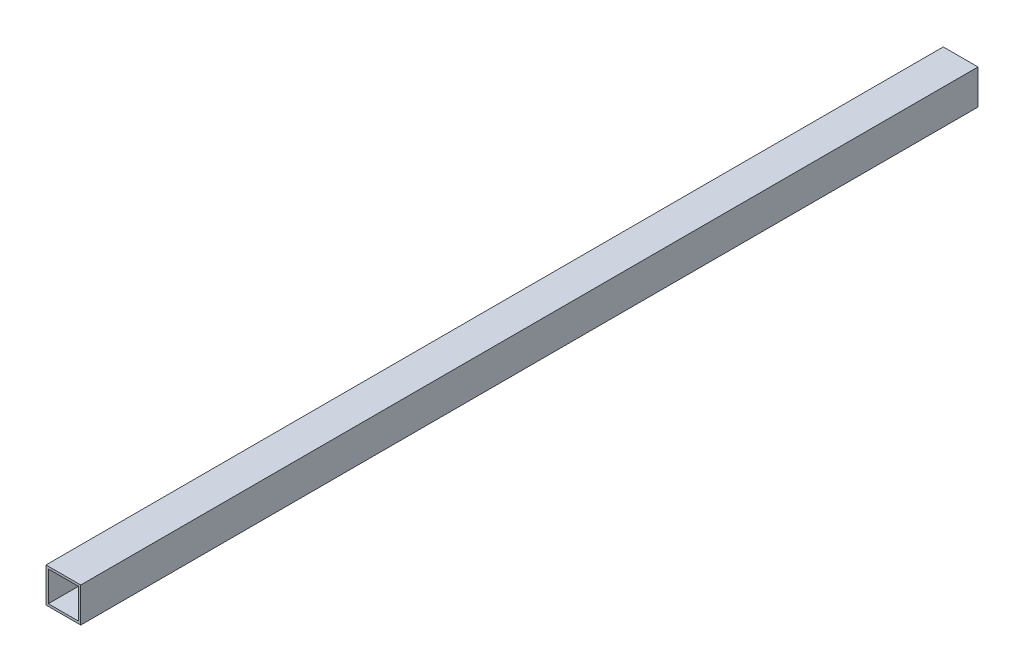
ISO-10303-21;
HEADER;
FILE_DESCRIPTION(('STEP AP214'),'2;1');
FILE_NAME('part.step','',(''),(''),'','','');
FILE_SCHEMA(('AUTOMOTIVE_DESIGN { 1 0 10303 214 1 1 1 1 }'));
ENDSEC;
DATA;
#1=APPLICATION_CONTEXT('core data for automotive mechanical design processes');
#2=APPLICATION_PROTOCOL_DEFINITION('international standard','automotive_design',2000,#1);
#3=PRODUCT_CONTEXT('',#1,'mechanical');
#4=PRODUCT('Part','Part','',(#3));
#5=PRODUCT_RELATED_PRODUCT_CATEGORY('part','',(#4));
#6=PRODUCT_DEFINITION_FORMATION('','',#4);
#7=PRODUCT_DEFINITION_CONTEXT('part definition',#1,'design');
#8=PRODUCT_DEFINITION('design','',#6,#7);
#9=PRODUCT_DEFINITION_SHAPE('','',#8);
#10=(LENGTH_UNIT() NAMED_UNIT(*) SI_UNIT(.MILLI.,.METRE.));
#11=(NAMED_UNIT(*) PLANE_ANGLE_UNIT() SI_UNIT($,.RADIAN.));
#12=(NAMED_UNIT(*) SI_UNIT($,.STERADIAN.) SOLID_ANGLE_UNIT());
#13=UNCERTAINTY_MEASURE_WITH_UNIT(LENGTH_MEASURE(1.E-05),#10,'distance_accuracy_value','');
#14=(GEOMETRIC_REPRESENTATION_CONTEXT(3) GLOBAL_UNCERTAINTY_ASSIGNED_CONTEXT((#13)) GLOBAL_UNIT_ASSIGNED_CONTEXT((#10,
#11,#12)) REPRESENTATION_CONTEXT('',''));
#15=CARTESIAN_POINT('',(0.,0.,0.));
#16=DIRECTION('',(0.,0.,1.));
#17=DIRECTION('',(1.,0.,0.));
#18=AXIS2_PLACEMENT_3D('',#15,#16,#17);
#19=CARTESIAN_POINT('',(0.,0.,1550.));
#20=DIRECTION('',(0.,0.,1.));
#21=DIRECTION('',(1.,0.,0.));
#22=AXIS2_PLACEMENT_3D('',#19,#20,#21);
#23=PLANE('',#22);
#24=DIRECTION('',(0.,-1.,0.));
#25=VECTOR('',#24,1.);
#26=CARTESIAN_POINT('',(-26.,26.,1550.));
#27=LINE('',#26,#25);
#28=CARTESIAN_POINT('',(-26.,26.,1550.));
#29=VERTEX_POINT('',#28);
#30=CARTESIAN_POINT('',(-26.,-26.,1550.));
#31=VERTEX_POINT('',#30);
#32=EDGE_CURVE('E25',#29,#31,#27,.T.);
#33=ORIENTED_EDGE('',*,*,#32,.F.);
#34=DIRECTION('',(-1.,0.,0.));
#35=VECTOR('',#34,1.);
#36=CARTESIAN_POINT('',(26.,26.,1550.));
#37=LINE('',#36,#35);
#38=CARTESIAN_POINT('',(26.,26.,1550.));
#39=VERTEX_POINT('',#38);
#40=EDGE_CURVE('E91',#39,#29,#37,.T.);
#41=ORIENTED_EDGE('',*,*,#40,.F.);
#42=DIRECTION('',(0.,1.,0.));
#43=VECTOR('',#42,1.);
#44=CARTESIAN_POINT('',(26.,-26.,1550.));
#45=LINE('',#44,#43);
#46=CARTESIAN_POINT('',(26.,-26.,1550.));
#47=VERTEX_POINT('',#46);
#48=EDGE_CURVE('E120',#47,#39,#45,.T.);
#49=ORIENTED_EDGE('',*,*,#48,.F.);
#50=DIRECTION('',(1.,0.,0.));
#51=VECTOR('',#50,1.);
#52=CARTESIAN_POINT('',(-26.,-26.,1550.));
#53=LINE('',#52,#51);
#54=EDGE_CURVE('E139',#31,#47,#53,.T.);
#55=ORIENTED_EDGE('',*,*,#54,.F.);
#56=EDGE_LOOP('',(#33,#41,#49,#55));
#57=FACE_BOUND('',#56,.T.);
#58=DIRECTION('',(1.,0.,0.));
#59=VECTOR('',#58,1.);
#60=CARTESIAN_POINT('',(-30.,-30.,1550.));
#61=LINE('',#60,#59);
#62=CARTESIAN_POINT('',(-30.,-30.,1550.));
#63=VERTEX_POINT('',#62);
#64=CARTESIAN_POINT('',(30.,-30.,1550.));
#65=VERTEX_POINT('',#64);
#66=EDGE_CURVE('E177',#63,#65,#61,.T.);
#67=ORIENTED_EDGE('',*,*,#66,.T.);
#68=DIRECTION('',(0.,1.,0.));
#69=VECTOR('',#68,1.);
#70=CARTESIAN_POINT('',(30.,-30.,1550.));
#71=LINE('',#70,#69);
#72=CARTESIAN_POINT('',(30.,30.,1550.));
#73=VERTEX_POINT('',#72);
#74=EDGE_CURVE('E166',#65,#73,#71,.T.);
#75=ORIENTED_EDGE('',*,*,#74,.T.);
#76=DIRECTION('',(-1.,0.,0.));
#77=VECTOR('',#76,1.);
#78=CARTESIAN_POINT('',(30.,30.,1550.));
#79=LINE('',#78,#77);
#80=CARTESIAN_POINT('',(-30.,30.,1550.));
#81=VERTEX_POINT('',#80);
#82=EDGE_CURVE('E156',#73,#81,#79,.T.);
#83=ORIENTED_EDGE('',*,*,#82,.T.);
#84=DIRECTION('',(0.,-1.,0.));
#85=VECTOR('',#84,1.);
#86=CARTESIAN_POINT('',(-30.,30.,1550.));
#87=LINE('',#86,#85);
#88=EDGE_CURVE('E146',#81,#63,#87,.T.);
#89=ORIENTED_EDGE('',*,*,#88,.T.);
#90=EDGE_LOOP('',(#67,#75,#83,#89));
#91=FACE_BOUND('',#90,.T.);
#92=ADVANCED_FACE('F16',(#57,#91),#23,.T.);
#93=CARTESIAN_POINT('',(0.,0.,0.));
#94=DIRECTION('',(0.,0.,1.));
#95=DIRECTION('',(1.,0.,0.));
#96=AXIS2_PLACEMENT_3D('',#93,#94,#95);
#97=PLANE('',#96);
#98=DIRECTION('',(1.,0.,0.));
#99=VECTOR('',#98,1.);
#100=CARTESIAN_POINT('',(-26.,-26.,0.));
#101=LINE('',#100,#99);
#102=CARTESIAN_POINT('',(-26.,-26.,0.));
#103=VERTEX_POINT('',#102);
#104=CARTESIAN_POINT('',(26.,-26.,0.));
#105=VERTEX_POINT('',#104);
#106=EDGE_CURVE('E113',#103,#105,#101,.T.);
#107=ORIENTED_EDGE('',*,*,#106,.T.);
#108=DIRECTION('',(0.,1.,0.));
#109=VECTOR('',#108,1.);
#110=CARTESIAN_POINT('',(26.,-26.,0.));
#111=LINE('',#110,#109);
#112=CARTESIAN_POINT('',(26.,26.,0.));
#113=VERTEX_POINT('',#112);
#114=EDGE_CURVE('E109',#105,#113,#111,.T.);
#115=ORIENTED_EDGE('',*,*,#114,.T.);
#116=DIRECTION('',(-1.,0.,0.));
#117=VECTOR('',#116,1.);
#118=CARTESIAN_POINT('',(26.,26.,0.));
#119=LINE('',#118,#117);
#120=CARTESIAN_POINT('',(-26.,26.,0.));
#121=VERTEX_POINT('',#120);
#122=EDGE_CURVE('E99',#113,#121,#119,.T.);
#123=ORIENTED_EDGE('',*,*,#122,.T.);
#124=DIRECTION('',(0.,-1.,0.));
#125=VECTOR('',#124,1.);
#126=CARTESIAN_POINT('',(-26.,26.,0.));
#127=LINE('',#126,#125);
#128=EDGE_CURVE('E10',#121,#103,#127,.T.);
#129=ORIENTED_EDGE('',*,*,#128,.T.);
#130=EDGE_LOOP('',(#107,#115,#123,#129));
#131=FACE_BOUND('',#130,.T.);
#132=DIRECTION('',(0.,-1.,0.));
#133=VECTOR('',#132,1.);
#134=CARTESIAN_POINT('',(-30.,30.,0.));
#135=LINE('',#134,#133);
#136=CARTESIAN_POINT('',(-30.,30.,0.));
#137=VERTEX_POINT('',#136);
#138=CARTESIAN_POINT('',(-30.,-30.,0.));
#139=VERTEX_POINT('',#138);
#140=EDGE_CURVE('E151',#137,#139,#135,.T.);
#141=ORIENTED_EDGE('',*,*,#140,.F.);
#142=DIRECTION('',(-1.,0.,0.));
#143=VECTOR('',#142,1.);
#144=CARTESIAN_POINT('',(30.,30.,0.));
#145=LINE('',#144,#143);
#146=CARTESIAN_POINT('',(30.,30.,0.));
#147=VERTEX_POINT('',#146);
#148=EDGE_CURVE('E163',#147,#137,#145,.T.);
#149=ORIENTED_EDGE('',*,*,#148,.F.);
#150=DIRECTION('',(0.,1.,0.));
#151=VECTOR('',#150,1.);
#152=CARTESIAN_POINT('',(30.,-30.,0.));
#153=LINE('',#152,#151);
#154=CARTESIAN_POINT('',(30.,-30.,0.));
#155=VERTEX_POINT('',#154);
#156=EDGE_CURVE('E172',#155,#147,#153,.T.);
#157=ORIENTED_EDGE('',*,*,#156,.F.);
#158=DIRECTION('',(1.,0.,0.));
#159=VECTOR('',#158,1.);
#160=CARTESIAN_POINT('',(-30.,-30.,0.));
#161=LINE('',#160,#159);
#162=EDGE_CURVE('E191',#139,#155,#161,.T.);
#163=ORIENTED_EDGE('',*,*,#162,.F.);
#164=EDGE_LOOP('',(#141,#149,#157,#163));
#165=FACE_BOUND('',#164,.T.);
#166=ADVANCED_FACE('F110',(#131,#165),#97,.F.);
#167=CARTESIAN_POINT('',(-26.,26.,0.));
#168=DIRECTION('',(1.,0.,0.));
#169=DIRECTION('',(0.,1.,0.));
#170=AXIS2_PLACEMENT_3D('',#167,#168,#169);
#171=PLANE('',#170);
#172=DIRECTION('',(0.,0.,1.));
#173=VECTOR('',#172,1.);
#174=CARTESIAN_POINT('',(-26.,26.,0.));
#175=LINE('',#174,#173);
#176=EDGE_CURVE('E105',#121,#29,#175,.T.);
#177=ORIENTED_EDGE('',*,*,#176,.T.);
#178=ORIENTED_EDGE('',*,*,#32,.T.);
#179=DIRECTION('',(0.,0.,1.));
#180=VECTOR('',#179,1.);
#181=CARTESIAN_POINT('',(-26.,-26.,0.));
#182=LINE('',#181,#180);
#183=EDGE_CURVE('E135',#103,#31,#182,.T.);
#184=ORIENTED_EDGE('',*,*,#183,.F.);
#185=ORIENTED_EDGE('',*,*,#128,.F.);
#186=EDGE_LOOP('',(#177,#178,#184,#185));
#187=FACE_BOUND('',#186,.T.);
#188=ADVANCED_FACE('F132',(#187),#171,.T.);
#189=CARTESIAN_POINT('',(26.,26.,0.));
#190=DIRECTION('',(0.,-1.,0.));
#191=DIRECTION('',(0.,0.,-1.));
#192=AXIS2_PLACEMENT_3D('',#189,#190,#191);
#193=PLANE('',#192);
#194=DIRECTION('',(0.,0.,1.));
#195=VECTOR('',#194,1.);
#196=CARTESIAN_POINT('',(26.,26.,0.));
#197=LINE('',#196,#195);
#198=EDGE_CURVE('E103',#113,#39,#197,.T.);
#199=ORIENTED_EDGE('',*,*,#198,.T.);
#200=ORIENTED_EDGE('',*,*,#40,.T.);
#201=ORIENTED_EDGE('',*,*,#176,.F.);
#202=ORIENTED_EDGE('',*,*,#122,.F.);
#203=EDGE_LOOP('',(#199,#200,#201,#202));
#204=FACE_BOUND('',#203,.T.);
#205=ADVANCED_FACE('F101',(#204),#193,.T.);
#206=CARTESIAN_POINT('',(26.,-26.,0.));
#207=DIRECTION('',(-1.,0.,0.));
#208=DIRECTION('',(0.,0.,1.));
#209=AXIS2_PLACEMENT_3D('',#206,#207,#208);
#210=PLANE('',#209);
#211=DIRECTION('',(0.,0.,1.));
#212=VECTOR('',#211,1.);
#213=CARTESIAN_POINT('',(26.,-26.,0.));
#214=LINE('',#213,#212);
#215=EDGE_CURVE('E143',#105,#47,#214,.T.);
#216=ORIENTED_EDGE('',*,*,#215,.T.);
#217=ORIENTED_EDGE('',*,*,#48,.T.);
#218=ORIENTED_EDGE('',*,*,#198,.F.);
#219=ORIENTED_EDGE('',*,*,#114,.F.);
#220=EDGE_LOOP('',(#216,#217,#218,#219));
#221=FACE_BOUND('',#220,.T.);
#222=ADVANCED_FACE('F119',(#221),#210,.T.);
#223=CARTESIAN_POINT('',(-26.,-26.,0.));
#224=DIRECTION('',(0.,1.,0.));
#225=DIRECTION('',(1.,0.,0.));
#226=AXIS2_PLACEMENT_3D('',#223,#224,#225);
#227=PLANE('',#226);
#228=ORIENTED_EDGE('',*,*,#183,.T.);
#229=ORIENTED_EDGE('',*,*,#54,.T.);
#230=ORIENTED_EDGE('',*,*,#215,.F.);
#231=ORIENTED_EDGE('',*,*,#106,.F.);
#232=EDGE_LOOP('',(#228,#229,#230,#231));
#233=FACE_BOUND('',#232,.T.);
#234=ADVANCED_FACE('F144',(#233),#227,.T.);
#235=CARTESIAN_POINT('',(-30.,30.,0.));
#236=DIRECTION('',(1.,0.,0.));
#237=DIRECTION('',(0.,1.,0.));
#238=AXIS2_PLACEMENT_3D('',#235,#236,#237);
#239=PLANE('',#238);
#240=ORIENTED_EDGE('',*,*,#140,.T.);
#241=DIRECTION('',(0.,0.,1.));
#242=VECTOR('',#241,1.);
#243=CARTESIAN_POINT('',(-30.,-30.,0.));
#244=LINE('',#243,#242);
#245=EDGE_CURVE('E173',#139,#63,#244,.T.);
#246=ORIENTED_EDGE('',*,*,#245,.T.);
#247=ORIENTED_EDGE('',*,*,#88,.F.);
#248=DIRECTION('',(0.,0.,1.));
#249=VECTOR('',#248,1.);
#250=CARTESIAN_POINT('',(-30.,30.,0.));
#251=LINE('',#250,#249);
#252=EDGE_CURVE('E160',#137,#81,#251,.T.);
#253=ORIENTED_EDGE('',*,*,#252,.F.);
#254=EDGE_LOOP('',(#240,#246,#247,#253));
#255=FACE_BOUND('',#254,.T.);
#256=ADVANCED_FACE('F209',(#255),#239,.F.);
#257=CARTESIAN_POINT('',(30.,30.,0.));
#258=DIRECTION('',(0.,-1.,0.));
#259=DIRECTION('',(0.,0.,-1.));
#260=AXIS2_PLACEMENT_3D('',#257,#258,#259);
#261=PLANE('',#260);
#262=ORIENTED_EDGE('',*,*,#148,.T.);
#263=ORIENTED_EDGE('',*,*,#252,.T.);
#264=ORIENTED_EDGE('',*,*,#82,.F.);
#265=DIRECTION('',(0.,0.,1.));
#266=VECTOR('',#265,1.);
#267=CARTESIAN_POINT('',(30.,30.,0.));
#268=LINE('',#267,#266);
#269=EDGE_CURVE('E168',#147,#73,#268,.T.);
#270=ORIENTED_EDGE('',*,*,#269,.F.);
#271=EDGE_LOOP('',(#262,#263,#264,#270));
#272=FACE_BOUND('',#271,.T.);
#273=ADVANCED_FACE('F212',(#272),#261,.F.);
#274=CARTESIAN_POINT('',(30.,-30.,0.));
#275=DIRECTION('',(-1.,0.,0.));
#276=DIRECTION('',(0.,0.,1.));
#277=AXIS2_PLACEMENT_3D('',#274,#275,#276);
#278=PLANE('',#277);
#279=ORIENTED_EDGE('',*,*,#156,.T.);
#280=ORIENTED_EDGE('',*,*,#269,.T.);
#281=ORIENTED_EDGE('',*,*,#74,.F.);
#282=DIRECTION('',(0.,0.,1.));
#283=VECTOR('',#282,1.);
#284=CARTESIAN_POINT('',(30.,-30.,0.));
#285=LINE('',#284,#283);
#286=EDGE_CURVE('E187',#155,#65,#285,.T.);
#287=ORIENTED_EDGE('',*,*,#286,.F.);
#288=EDGE_LOOP('',(#279,#280,#281,#287));
#289=FACE_BOUND('',#288,.T.);
#290=ADVANCED_FACE('F214',(#289),#278,.F.);
#291=CARTESIAN_POINT('',(-30.,-30.,0.));
#292=DIRECTION('',(0.,1.,0.));
#293=DIRECTION('',(1.,0.,0.));
#294=AXIS2_PLACEMENT_3D('',#291,#292,#293);
#295=PLANE('',#294);
#296=ORIENTED_EDGE('',*,*,#162,.T.);
#297=ORIENTED_EDGE('',*,*,#286,.T.);
#298=ORIENTED_EDGE('',*,*,#66,.F.);
#299=ORIENTED_EDGE('',*,*,#245,.F.);
#300=EDGE_LOOP('',(#296,#297,#298,#299));
#301=FACE_BOUND('',#300,.T.);
#302=ADVANCED_FACE('F203',(#301),#295,.F.);
#303=CLOSED_SHELL('',(#92,#166,#188,#205,#222,#234,#256,#273,#290,#302));
#304=MANIFOLD_SOLID_BREP('B1',#303);
#305=ADVANCED_BREP_SHAPE_REPRESENTATION('',(#18,#304),#14);
#306=SHAPE_DEFINITION_REPRESENTATION(#9,#305);
ENDSEC;
END-ISO-10303-21;
